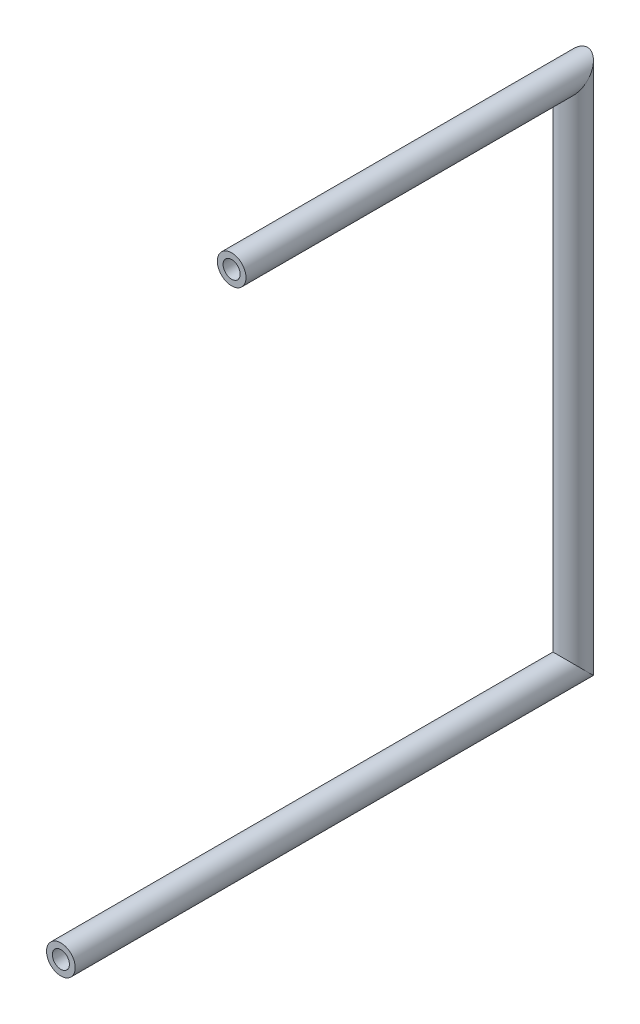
from build123d import *

# Parameters (mm, degrees)
SKETCH1_R   = 10.668
SKETCH1_R_2 = 6.35


with BuildPart() as part:
    # Sweep1: sweep along a path in Sketch2
    with BuildLine(Plane(origin=(0, 0, 0), x_dir=(0, 0, -1), z_dir=(1, 0, 0))) as sweep1_path:
        Line((0, 0), (381, 0))
        Line((381, 0), (381, 381))
        Line((381, 381), (127, 381))
    # Sketch1 → Sweep1 (sweep)
    with BuildSketch(Plane.XY):
        Circle(SKETCH1_R)
        Circle(SKETCH1_R_2, mode=Mode.SUBTRACT)
    sweep(path=sweep1_path.line, transition=Transition.RIGHT)


solid = part.part
